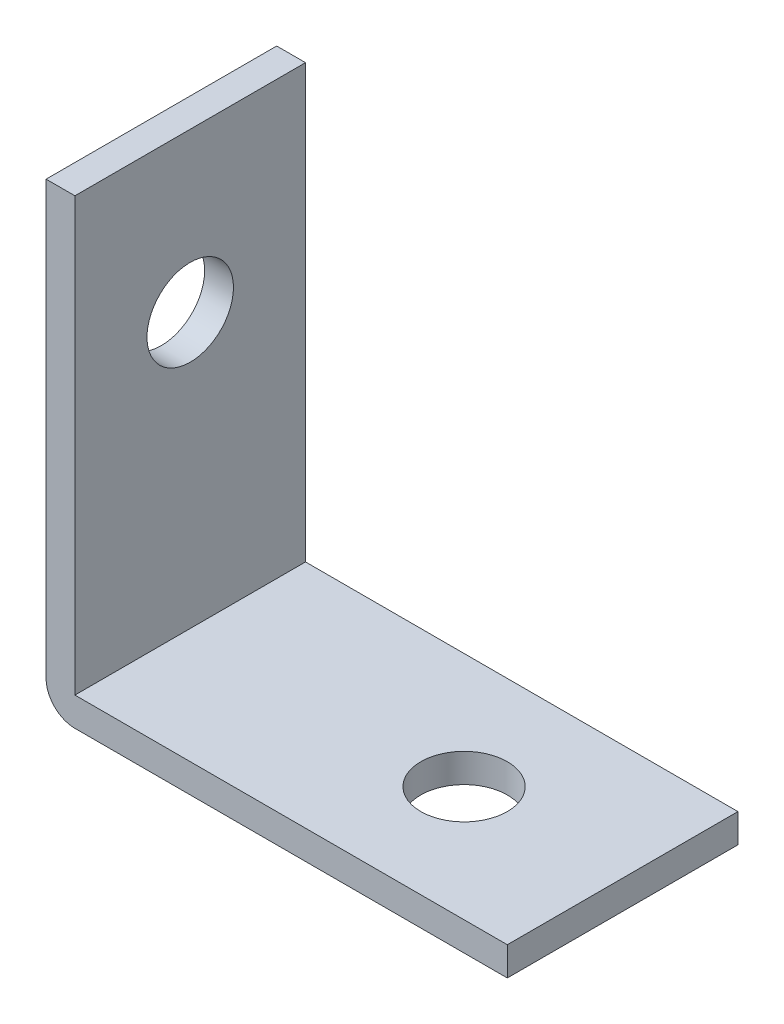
from build123d import *

# Parameters (mm, degrees)
SKETCH1_W           = 25.4
SKETCH1_H           = 12.7
SKETCH1_R           = 2.38125
BOSS_EXTRUDE1_DEPTH = 1.5875
SKETCH2_W           = 1.5875
SKETCH2_H           = 12.7
BOSS_EXTRUDE2_DEPTH = 23.8125
SKETCH3_R           = 2.38125
CUT_EXTRUDE1_DEPTH  = 35.269415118
FILLET1_R           = 1.5875


with BuildPart() as part:
    # Sketch1 → Boss-Extrude1 (new body)
    with BuildSketch(Plane(origin=(0, 0, 0), x_dir=(1, 0, 0), z_dir=(0, 1, 0))):
        with Locations((12.7, 0)):
            Rectangle(SKETCH1_W, SKETCH1_H)
        with Locations(Location((16.66875, 0, 0), (0, 0, 270))):
            Circle(SKETCH1_R, mode=Mode.SUBTRACT)
    extrude(amount=-BOSS_EXTRUDE1_DEPTH)

    # Sketch2 → Boss-Extrude2 (add)
    with BuildSketch(Plane(origin=(0, 0, 0), x_dir=(1, 0, 0), z_dir=(0, 1, 0))):
        with Locations((0.79375, 0)):
            Rectangle(SKETCH2_W, SKETCH2_H)
    extrude(amount=BOSS_EXTRUDE2_DEPTH)

    # Sketch3 → Cut-Extrude1 (cut, through all)
    with BuildSketch(Plane(origin=(1.5875, 0, 0), x_dir=(0, 0, -1), z_dir=(1, 0, 0))):
        with Locations((0, 15.08125)):
            Circle(SKETCH3_R)
    extrude(amount=-CUT_EXTRUDE1_DEPTH, mode=Mode.SUBTRACT)

    # Fillet1
    fillet1_edges = [part.edges().sort_by_distance(p)[0] for p in [
        (0, -1.5875, 0),
    ]]
    fillet(fillet1_edges, radius=FILLET1_R)


solid = part.part
